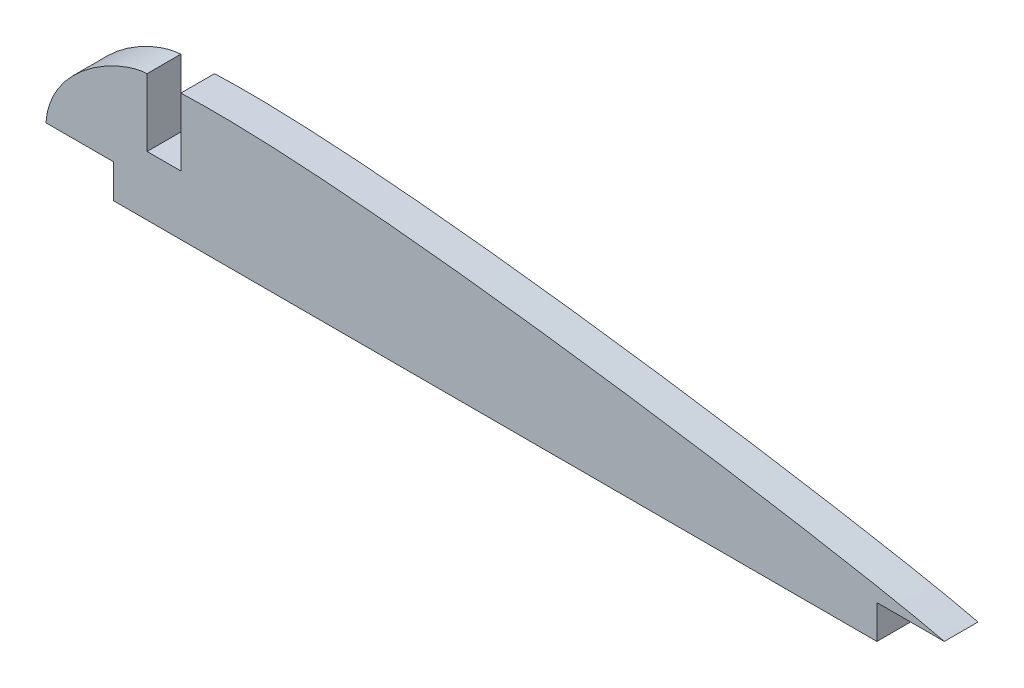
ISO-10303-21;
HEADER;
FILE_DESCRIPTION(('STEP AP214'),'2;1');
FILE_NAME('part.step','',(''),(''),'','','');
FILE_SCHEMA(('AUTOMOTIVE_DESIGN { 1 0 10303 214 1 1 1 1 }'));
ENDSEC;
DATA;
#1=APPLICATION_CONTEXT('core data for automotive mechanical design processes');
#2=APPLICATION_PROTOCOL_DEFINITION('international standard','automotive_design',2000,#1);
#3=PRODUCT_CONTEXT('',#1,'mechanical');
#4=PRODUCT('Part','Part','',(#3));
#5=PRODUCT_RELATED_PRODUCT_CATEGORY('part','',(#4));
#6=PRODUCT_DEFINITION_FORMATION('','',#4);
#7=PRODUCT_DEFINITION_CONTEXT('part definition',#1,'design');
#8=PRODUCT_DEFINITION('design','',#6,#7);
#9=PRODUCT_DEFINITION_SHAPE('','',#8);
#10=(LENGTH_UNIT() NAMED_UNIT(*) SI_UNIT(.MILLI.,.METRE.));
#11=(NAMED_UNIT(*) PLANE_ANGLE_UNIT() SI_UNIT($,.RADIAN.));
#12=(NAMED_UNIT(*) SI_UNIT($,.STERADIAN.) SOLID_ANGLE_UNIT());
#13=UNCERTAINTY_MEASURE_WITH_UNIT(LENGTH_MEASURE(1.E-05),#10,'distance_accuracy_value','');
#14=(GEOMETRIC_REPRESENTATION_CONTEXT(3) GLOBAL_UNCERTAINTY_ASSIGNED_CONTEXT((#13)) GLOBAL_UNIT_ASSIGNED_CONTEXT((#10,
#11,#12)) REPRESENTATION_CONTEXT('',''));
#15=CARTESIAN_POINT('',(0.,0.,0.));
#16=DIRECTION('',(0.,0.,1.));
#17=DIRECTION('',(1.,0.,0.));
#18=AXIS2_PLACEMENT_3D('',#15,#16,#17);
#19=CARTESIAN_POINT('',(0.,26.7990639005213,3.175));
#20=DIRECTION('',(-1.,0.,0.));
#21=DIRECTION('',(0.,-1.,0.));
#22=AXIS2_PLACEMENT_3D('',#19,#20,#21);
#23=PLANE('',#22);
#24=DIRECTION('',(0.,1.,0.));
#25=VECTOR('',#24,1.);
#26=CARTESIAN_POINT('',(0.,26.7990639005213,0.));
#27=LINE('',#26,#25);
#28=CARTESIAN_POINT('',(0.,26.7990639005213,0.));
#29=VERTEX_POINT('',#28);
#30=CARTESIAN_POINT('',(0.,33.1490639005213,0.));
#31=VERTEX_POINT('',#30);
#32=EDGE_CURVE('E144',#29,#31,#27,.T.);
#33=ORIENTED_EDGE('',*,*,#32,.T.);
#34=DIRECTION('',(0.,0.,-1.));
#35=VECTOR('',#34,1.);
#36=CARTESIAN_POINT('',(0.,33.1490639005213,3.175));
#37=LINE('',#36,#35);
#38=CARTESIAN_POINT('',(0.,33.1490639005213,3.175));
#39=VERTEX_POINT('',#38);
#40=EDGE_CURVE('E11',#39,#31,#37,.T.);
#41=ORIENTED_EDGE('',*,*,#40,.F.);
#42=DIRECTION('',(0.,1.,0.));
#43=VECTOR('',#42,1.);
#44=CARTESIAN_POINT('',(0.,26.7990639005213,3.175));
#45=LINE('',#44,#43);
#46=CARTESIAN_POINT('',(0.,26.7990639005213,3.175));
#47=VERTEX_POINT('',#46);
#48=EDGE_CURVE('E173',#47,#39,#45,.T.);
#49=ORIENTED_EDGE('',*,*,#48,.F.);
#50=DIRECTION('',(0.,0.,-1.));
#51=VECTOR('',#50,1.);
#52=CARTESIAN_POINT('',(0.,26.7990639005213,3.175));
#53=LINE('',#52,#51);
#54=EDGE_CURVE('E137',#47,#29,#53,.T.);
#55=ORIENTED_EDGE('',*,*,#54,.T.);
#56=EDGE_LOOP('',(#33,#41,#49,#55));
#57=FACE_BOUND('',#56,.T.);
#58=ADVANCED_FACE('F33',(#57),#23,.F.);
#59=CARTESIAN_POINT('',(0.,33.1490639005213,3.175));
#60=CARTESIAN_POINT('',(-2.85432040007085,33.0274123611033,3.175));
#61=CARTESIAN_POINT('',(-9.19986094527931,29.4539526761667,3.175));
#62=CARTESIAN_POINT('',(-9.52499999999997,24.3736282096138,3.175));
#63=B_SPLINE_CURVE_WITH_KNOTS('',3,(#59,#60,#61,#62),.UNSPECIFIED.,.F.,.F.,(4,4),(0.,1.),.UNSPECIFIED.);
#64=DIRECTION('',(0.,0.,-1.));
#65=VECTOR('',#64,1.);
#66=SURFACE_OF_LINEAR_EXTRUSION('',#63,#65);
#67=CARTESIAN_POINT('',(0.,33.1490639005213,0.));
#68=CARTESIAN_POINT('',(-2.85432040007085,33.0274123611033,0.));
#69=CARTESIAN_POINT('',(-9.19986094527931,29.4539526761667,0.));
#70=CARTESIAN_POINT('',(-9.52499999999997,24.3736282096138,0.));
#71=B_SPLINE_CURVE_WITH_KNOTS('',3,(#67,#68,#69,#70),.UNSPECIFIED.,.F.,.F.,(4,4),(0.,1.),.UNSPECIFIED.);
#72=CARTESIAN_POINT('',(-9.52499999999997,24.3736282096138,0.));
#73=VERTEX_POINT('',#72);
#74=EDGE_CURVE('E147',#31,#73,#71,.T.);
#75=ORIENTED_EDGE('',*,*,#74,.T.);
#76=DIRECTION('',(0.,0.,-1.));
#77=VECTOR('',#76,1.);
#78=CARTESIAN_POINT('',(-9.52499999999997,24.3736282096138,3.175));
#79=LINE('',#78,#77);
#80=CARTESIAN_POINT('',(-9.52499999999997,24.3736282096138,3.175));
#81=VERTEX_POINT('',#80);
#82=EDGE_CURVE('E41',#81,#73,#79,.T.);
#83=ORIENTED_EDGE('',*,*,#82,.F.);
#84=EDGE_CURVE('E98',#39,#81,#63,.T.);
#85=ORIENTED_EDGE('',*,*,#84,.F.);
#86=ORIENTED_EDGE('',*,*,#40,.T.);
#87=EDGE_LOOP('',(#75,#83,#85,#86));
#88=FACE_BOUND('',#87,.T.);
#89=ADVANCED_FACE('F224',(#88),#66,.F.);
#90=CARTESIAN_POINT('',(-9.52499999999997,24.3736282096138,3.175));
#91=DIRECTION('',(0.,1.,0.));
#92=DIRECTION('',(0.,0.,1.));
#93=AXIS2_PLACEMENT_3D('',#90,#91,#92);
#94=PLANE('',#93);
#95=DIRECTION('',(1.,0.,0.));
#96=VECTOR('',#95,1.);
#97=CARTESIAN_POINT('',(-9.52499999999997,24.3736282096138,0.));
#98=LINE('',#97,#96);
#99=CARTESIAN_POINT('',(-3.17499999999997,24.3736282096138,0.));
#100=VERTEX_POINT('',#99);
#101=EDGE_CURVE('E151',#73,#100,#98,.T.);
#102=ORIENTED_EDGE('',*,*,#101,.T.);
#103=DIRECTION('',(0.,0.,-1.));
#104=VECTOR('',#103,1.);
#105=CARTESIAN_POINT('',(-3.17499999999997,24.3736282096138,3.175));
#106=LINE('',#105,#104);
#107=CARTESIAN_POINT('',(-3.17499999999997,24.3736282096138,3.175));
#108=VERTEX_POINT('',#107);
#109=EDGE_CURVE('E186',#108,#100,#106,.T.);
#110=ORIENTED_EDGE('',*,*,#109,.F.);
#111=DIRECTION('',(1.,0.,0.));
#112=VECTOR('',#111,1.);
#113=CARTESIAN_POINT('',(-9.52499999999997,24.3736282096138,3.175));
#114=LINE('',#113,#112);
#115=EDGE_CURVE('E194',#81,#108,#114,.T.);
#116=ORIENTED_EDGE('',*,*,#115,.F.);
#117=ORIENTED_EDGE('',*,*,#82,.T.);
#118=EDGE_LOOP('',(#102,#110,#116,#117));
#119=FACE_BOUND('',#118,.T.);
#120=ADVANCED_FACE('F192',(#119),#94,.F.);
#121=CARTESIAN_POINT('',(-3.17499999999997,24.3736282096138,3.175));
#122=DIRECTION('',(1.,0.,0.));
#123=DIRECTION('',(0.,1.,0.));
#124=AXIS2_PLACEMENT_3D('',#121,#122,#123);
#125=PLANE('',#124);
#126=DIRECTION('',(0.,-1.,0.));
#127=VECTOR('',#126,1.);
#128=CARTESIAN_POINT('',(-3.17499999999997,24.3736282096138,0.));
#129=LINE('',#128,#127);
#130=CARTESIAN_POINT('',(-3.17499999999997,21.1986282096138,0.));
#131=VERTEX_POINT('',#130);
#132=EDGE_CURVE('E156',#100,#131,#129,.T.);
#133=ORIENTED_EDGE('',*,*,#132,.T.);
#134=DIRECTION('',(0.,0.,-1.));
#135=VECTOR('',#134,1.);
#136=CARTESIAN_POINT('',(-3.17499999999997,21.1986282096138,3.175));
#137=LINE('',#136,#135);
#138=CARTESIAN_POINT('',(-3.17499999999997,21.1986282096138,3.175));
#139=VERTEX_POINT('',#138);
#140=EDGE_CURVE('E183',#139,#131,#137,.T.);
#141=ORIENTED_EDGE('',*,*,#140,.F.);
#142=DIRECTION('',(0.,-1.,0.));
#143=VECTOR('',#142,1.);
#144=CARTESIAN_POINT('',(-3.17499999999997,24.3736282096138,3.175));
#145=LINE('',#144,#143);
#146=EDGE_CURVE('E211',#108,#139,#145,.T.);
#147=ORIENTED_EDGE('',*,*,#146,.F.);
#148=ORIENTED_EDGE('',*,*,#109,.T.);
#149=EDGE_LOOP('',(#133,#141,#147,#148));
#150=FACE_BOUND('',#149,.T.);
#151=ADVANCED_FACE('F202',(#150),#125,.F.);
#152=CARTESIAN_POINT('',(3.17500000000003,21.1986282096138,3.175));
#153=DIRECTION('',(0.,1.,0.));
#154=DIRECTION('',(0.,0.,1.));
#155=AXIS2_PLACEMENT_3D('',#152,#153,#154);
#156=PLANE('',#155);
#157=DIRECTION('',(1.,0.,0.));
#158=VECTOR('',#157,1.);
#159=CARTESIAN_POINT('',(3.17500000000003,21.1986282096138,0.));
#160=LINE('',#159,#158);
#161=CARTESIAN_POINT('',(68.7525007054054,21.1986282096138,0.));
#162=VERTEX_POINT('',#161);
#163=EDGE_CURVE('E159',#131,#162,#160,.T.);
#164=ORIENTED_EDGE('',*,*,#163,.T.);
#165=DIRECTION('',(0.,0.,-1.));
#166=VECTOR('',#165,1.);
#167=CARTESIAN_POINT('',(68.7525007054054,21.1986282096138,3.175));
#168=LINE('',#167,#166);
#169=CARTESIAN_POINT('',(68.7525007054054,21.1986282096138,3.175));
#170=VERTEX_POINT('',#169);
#171=EDGE_CURVE('E180',#170,#162,#168,.T.);
#172=ORIENTED_EDGE('',*,*,#171,.F.);
#173=DIRECTION('',(1.,0.,0.));
#174=VECTOR('',#173,1.);
#175=CARTESIAN_POINT('',(3.17500000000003,21.1986282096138,3.175));
#176=LINE('',#175,#174);
#177=EDGE_CURVE('E208',#139,#170,#176,.T.);
#178=ORIENTED_EDGE('',*,*,#177,.F.);
#179=ORIENTED_EDGE('',*,*,#140,.T.);
#180=EDGE_LOOP('',(#164,#172,#178,#179));
#181=FACE_BOUND('',#180,.T.);
#182=ADVANCED_FACE('F206',(#181),#156,.F.);
#183=CARTESIAN_POINT('',(68.7525007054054,24.3736282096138,3.175));
#184=DIRECTION('',(-1.,0.,0.));
#185=DIRECTION('',(0.,0.,1.));
#186=AXIS2_PLACEMENT_3D('',#183,#184,#185);
#187=PLANE('',#186);
#188=DIRECTION('',(0.,1.,0.));
#189=VECTOR('',#188,1.);
#190=CARTESIAN_POINT('',(68.7525007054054,24.3736282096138,0.));
#191=LINE('',#190,#189);
#192=CARTESIAN_POINT('',(68.7525007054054,24.3736282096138,0.));
#193=VERTEX_POINT('',#192);
#194=EDGE_CURVE('E161',#162,#193,#191,.T.);
#195=ORIENTED_EDGE('',*,*,#194,.T.);
#196=DIRECTION('',(0.,0.,-1.));
#197=VECTOR('',#196,1.);
#198=CARTESIAN_POINT('',(68.7525007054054,24.3736282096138,3.175));
#199=LINE('',#198,#197);
#200=CARTESIAN_POINT('',(68.7525007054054,24.3736282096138,3.175));
#201=VERTEX_POINT('',#200);
#202=EDGE_CURVE('E177',#201,#193,#199,.T.);
#203=ORIENTED_EDGE('',*,*,#202,.F.);
#204=DIRECTION('',(0.,1.,0.));
#205=VECTOR('',#204,1.);
#206=CARTESIAN_POINT('',(68.7525007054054,24.3736282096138,3.175));
#207=LINE('',#206,#205);
#208=EDGE_CURVE('E210',#170,#201,#207,.T.);
#209=ORIENTED_EDGE('',*,*,#208,.F.);
#210=ORIENTED_EDGE('',*,*,#171,.T.);
#211=EDGE_LOOP('',(#195,#203,#209,#210));
#212=FACE_BOUND('',#211,.T.);
#213=ADVANCED_FACE('F233',(#212),#187,.F.);
#214=CARTESIAN_POINT('',(75.1025007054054,24.3736282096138,3.175));
#215=DIRECTION('',(0.,1.,0.));
#216=DIRECTION('',(0.,0.,1.));
#217=AXIS2_PLACEMENT_3D('',#214,#215,#216);
#218=PLANE('',#217);
#219=DIRECTION('',(1.,0.,0.));
#220=VECTOR('',#219,1.);
#221=CARTESIAN_POINT('',(75.1025007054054,24.3736282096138,0.));
#222=LINE('',#221,#220);
#223=CARTESIAN_POINT('',(75.1025007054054,24.3736282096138,0.));
#224=VERTEX_POINT('',#223);
#225=EDGE_CURVE('E163',#193,#224,#222,.T.);
#226=ORIENTED_EDGE('',*,*,#225,.T.);
#227=DIRECTION('',(0.,0.,-1.));
#228=VECTOR('',#227,1.);
#229=CARTESIAN_POINT('',(75.1025007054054,24.3736282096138,3.175));
#230=LINE('',#229,#228);
#231=CARTESIAN_POINT('',(75.1025007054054,24.3736282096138,3.175));
#232=VERTEX_POINT('',#231);
#233=EDGE_CURVE('E132',#232,#224,#230,.T.);
#234=ORIENTED_EDGE('',*,*,#233,.F.);
#235=DIRECTION('',(1.,0.,0.));
#236=VECTOR('',#235,1.);
#237=CARTESIAN_POINT('',(75.1025007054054,24.3736282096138,3.175));
#238=LINE('',#237,#236);
#239=EDGE_CURVE('E123',#201,#232,#238,.T.);
#240=ORIENTED_EDGE('',*,*,#239,.F.);
#241=ORIENTED_EDGE('',*,*,#202,.T.);
#242=EDGE_LOOP('',(#226,#234,#240,#241));
#243=FACE_BOUND('',#242,.T.);
#244=ADVANCED_FACE('F236',(#243),#218,.F.);
#245=CARTESIAN_POINT('',(75.1025007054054,24.3736282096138,3.175));
#246=CARTESIAN_POINT('',(66.0369052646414,26.6618645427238,3.175));
#247=CARTESIAN_POINT('',(21.6969892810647,33.9251895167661,3.175));
#248=CARTESIAN_POINT('',(3.17500000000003,33.1490639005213,3.175));
#249=B_SPLINE_CURVE_WITH_KNOTS('',3,(#245,#246,#247,#248),.UNSPECIFIED.,.F.,.F.,(4,4),(0.,1.),.UNSPECIFIED.);
#250=DIRECTION('',(0.,0.,-1.));
#251=VECTOR('',#250,1.);
#252=SURFACE_OF_LINEAR_EXTRUSION('',#249,#251);
#253=CARTESIAN_POINT('',(75.1025007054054,24.3736282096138,0.));
#254=CARTESIAN_POINT('',(66.0369052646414,26.6618645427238,0.));
#255=CARTESIAN_POINT('',(21.6969892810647,33.9251895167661,0.));
#256=CARTESIAN_POINT('',(3.17500000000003,33.1490639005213,0.));
#257=B_SPLINE_CURVE_WITH_KNOTS('',3,(#253,#254,#255,#256),.UNSPECIFIED.,.F.,.F.,(4,4),(0.,1.),.UNSPECIFIED.);
#258=CARTESIAN_POINT('',(3.17500000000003,33.1490639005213,0.));
#259=VERTEX_POINT('',#258);
#260=EDGE_CURVE('E131',#224,#259,#257,.T.);
#261=ORIENTED_EDGE('',*,*,#260,.T.);
#262=DIRECTION('',(0.,0.,-1.));
#263=VECTOR('',#262,1.);
#264=CARTESIAN_POINT('',(3.17500000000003,33.1490639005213,3.175));
#265=LINE('',#264,#263);
#266=CARTESIAN_POINT('',(3.17500000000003,33.1490639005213,3.175));
#267=VERTEX_POINT('',#266);
#268=EDGE_CURVE('E128',#267,#259,#265,.T.);
#269=ORIENTED_EDGE('',*,*,#268,.F.);
#270=EDGE_CURVE('E117',#232,#267,#249,.T.);
#271=ORIENTED_EDGE('',*,*,#270,.F.);
#272=ORIENTED_EDGE('',*,*,#233,.T.);
#273=EDGE_LOOP('',(#261,#269,#271,#272));
#274=FACE_BOUND('',#273,.T.);
#275=ADVANCED_FACE('F129',(#274),#252,.F.);
#276=CARTESIAN_POINT('',(3.17500000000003,26.7990639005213,3.175));
#277=DIRECTION('',(1.,0.,0.));
#278=DIRECTION('',(0.,0.,-1.));
#279=AXIS2_PLACEMENT_3D('',#276,#277,#278);
#280=PLANE('',#279);
#281=DIRECTION('',(0.,-1.,0.));
#282=VECTOR('',#281,1.);
#283=CARTESIAN_POINT('',(3.17500000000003,26.7990639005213,0.));
#284=LINE('',#283,#282);
#285=CARTESIAN_POINT('',(3.17500000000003,26.7990639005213,0.));
#286=VERTEX_POINT('',#285);
#287=EDGE_CURVE('E84',#259,#286,#284,.T.);
#288=ORIENTED_EDGE('',*,*,#287,.T.);
#289=DIRECTION('',(0.,0.,-1.));
#290=VECTOR('',#289,1.);
#291=CARTESIAN_POINT('',(3.17500000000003,26.7990639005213,3.175));
#292=LINE('',#291,#290);
#293=CARTESIAN_POINT('',(3.17500000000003,26.7990639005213,3.175));
#294=VERTEX_POINT('',#293);
#295=EDGE_CURVE('E133',#294,#286,#292,.T.);
#296=ORIENTED_EDGE('',*,*,#295,.F.);
#297=DIRECTION('',(0.,-1.,0.));
#298=VECTOR('',#297,1.);
#299=CARTESIAN_POINT('',(3.17500000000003,26.7990639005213,3.175));
#300=LINE('',#299,#298);
#301=EDGE_CURVE('E121',#267,#294,#300,.T.);
#302=ORIENTED_EDGE('',*,*,#301,.F.);
#303=ORIENTED_EDGE('',*,*,#268,.T.);
#304=EDGE_LOOP('',(#288,#296,#302,#303));
#305=FACE_BOUND('',#304,.T.);
#306=ADVANCED_FACE('F135',(#305),#280,.F.);
#307=CARTESIAN_POINT('',(0.,26.7990639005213,3.175));
#308=DIRECTION('',(0.,-1.,0.));
#309=DIRECTION('',(0.,0.,-1.));
#310=AXIS2_PLACEMENT_3D('',#307,#308,#309);
#311=PLANE('',#310);
#312=DIRECTION('',(-1.,0.,0.));
#313=VECTOR('',#312,1.);
#314=CARTESIAN_POINT('',(0.,26.7990639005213,0.));
#315=LINE('',#314,#313);
#316=EDGE_CURVE('E90',#286,#29,#315,.T.);
#317=ORIENTED_EDGE('',*,*,#316,.T.);
#318=ORIENTED_EDGE('',*,*,#54,.F.);
#319=DIRECTION('',(-1.,0.,0.));
#320=VECTOR('',#319,1.);
#321=CARTESIAN_POINT('',(0.,26.7990639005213,3.175));
#322=LINE('',#321,#320);
#323=EDGE_CURVE('E49',#294,#47,#322,.T.);
#324=ORIENTED_EDGE('',*,*,#323,.F.);
#325=ORIENTED_EDGE('',*,*,#295,.T.);
#326=EDGE_LOOP('',(#317,#318,#324,#325));
#327=FACE_BOUND('',#326,.T.);
#328=ADVANCED_FACE('F245',(#327),#311,.F.);
#329=CARTESIAN_POINT('',(-5.71094300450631,30.6208484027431,3.175));
#330=DIRECTION('',(0.,0.,-1.));
#331=DIRECTION('',(-1.,0.,0.));
#332=AXIS2_PLACEMENT_3D('',#329,#330,#331);
#333=PLANE('',#332);
#334=ORIENTED_EDGE('',*,*,#48,.T.);
#335=ORIENTED_EDGE('',*,*,#84,.T.);
#336=ORIENTED_EDGE('',*,*,#115,.T.);
#337=ORIENTED_EDGE('',*,*,#146,.T.);
#338=ORIENTED_EDGE('',*,*,#177,.T.);
#339=ORIENTED_EDGE('',*,*,#208,.T.);
#340=ORIENTED_EDGE('',*,*,#239,.T.);
#341=ORIENTED_EDGE('',*,*,#270,.T.);
#342=ORIENTED_EDGE('',*,*,#301,.T.);
#343=ORIENTED_EDGE('',*,*,#323,.T.);
#344=EDGE_LOOP('',(#334,#335,#336,#337,#338,#339,#340,#341,#342,#343));
#345=FACE_BOUND('',#344,.T.);
#346=ADVANCED_FACE('F119',(#345),#333,.F.);
#347=CARTESIAN_POINT('',(-5.71094300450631,30.6208484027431,0.));
#348=DIRECTION('',(0.,0.,-1.));
#349=DIRECTION('',(-1.,0.,0.));
#350=AXIS2_PLACEMENT_3D('',#347,#348,#349);
#351=PLANE('',#350);
#352=ORIENTED_EDGE('',*,*,#32,.F.);
#353=ORIENTED_EDGE('',*,*,#316,.F.);
#354=ORIENTED_EDGE('',*,*,#287,.F.);
#355=ORIENTED_EDGE('',*,*,#260,.F.);
#356=ORIENTED_EDGE('',*,*,#225,.F.);
#357=ORIENTED_EDGE('',*,*,#194,.F.);
#358=ORIENTED_EDGE('',*,*,#163,.F.);
#359=ORIENTED_EDGE('',*,*,#132,.F.);
#360=ORIENTED_EDGE('',*,*,#101,.F.);
#361=ORIENTED_EDGE('',*,*,#74,.F.);
#362=EDGE_LOOP('',(#352,#353,#354,#355,#356,#357,#358,#359,#360,#361));
#363=FACE_BOUND('',#362,.T.);
#364=ADVANCED_FACE('F198',(#363),#351,.T.);
#365=CLOSED_SHELL('',(#58,#89,#120,#151,#182,#213,#244,#275,#306,#328,#346,#364));
#366=MANIFOLD_SOLID_BREP('B2',#365);
#367=ADVANCED_BREP_SHAPE_REPRESENTATION('',(#18,#366),#14);
#368=SHAPE_DEFINITION_REPRESENTATION(#9,#367);
ENDSEC;
END-ISO-10303-21;
